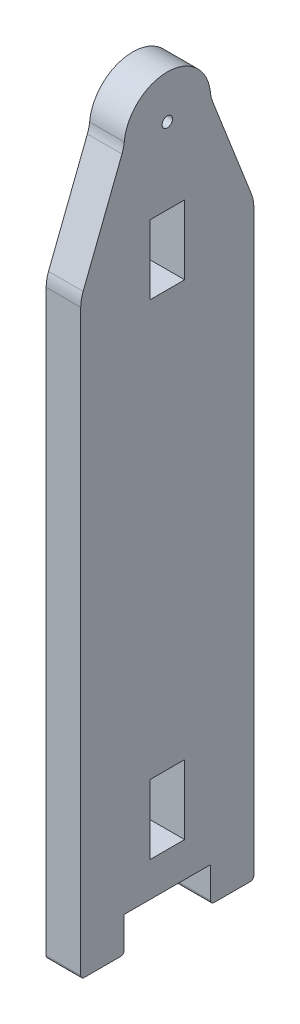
ISO-10303-21;
HEADER;
FILE_DESCRIPTION(('STEP AP214'),'2;1');
FILE_NAME('part.step','',(''),(''),'','','');
FILE_SCHEMA(('AUTOMOTIVE_DESIGN { 1 0 10303 214 1 1 1 1 }'));
ENDSEC;
DATA;
#1=APPLICATION_CONTEXT('core data for automotive mechanical design processes');
#2=APPLICATION_PROTOCOL_DEFINITION('international standard','automotive_design',2000,#1);
#3=PRODUCT_CONTEXT('',#1,'mechanical');
#4=PRODUCT('Part','Part','',(#3));
#5=PRODUCT_RELATED_PRODUCT_CATEGORY('part','',(#4));
#6=PRODUCT_DEFINITION_FORMATION('','',#4);
#7=PRODUCT_DEFINITION_CONTEXT('part definition',#1,'design');
#8=PRODUCT_DEFINITION('design','',#6,#7);
#9=PRODUCT_DEFINITION_SHAPE('','',#8);
#10=(LENGTH_UNIT() NAMED_UNIT(*) SI_UNIT(.MILLI.,.METRE.));
#11=(NAMED_UNIT(*) PLANE_ANGLE_UNIT() SI_UNIT($,.RADIAN.));
#12=(NAMED_UNIT(*) SI_UNIT($,.STERADIAN.) SOLID_ANGLE_UNIT());
#13=UNCERTAINTY_MEASURE_WITH_UNIT(LENGTH_MEASURE(1.E-05),#10,'distance_accuracy_value','');
#14=(GEOMETRIC_REPRESENTATION_CONTEXT(3) GLOBAL_UNCERTAINTY_ASSIGNED_CONTEXT((#13)) GLOBAL_UNIT_ASSIGNED_CONTEXT((#10,
#11,#12)) REPRESENTATION_CONTEXT('',''));
#15=CARTESIAN_POINT('',(0.,0.,0.));
#16=DIRECTION('',(0.,0.,1.));
#17=DIRECTION('',(1.,0.,0.));
#18=AXIS2_PLACEMENT_3D('',#15,#16,#17);
#19=CARTESIAN_POINT('',(20.,384.,0.));
#20=DIRECTION('',(1.,0.,0.));
#21=DIRECTION('',(0.,0.,-1.));
#22=AXIS2_PLACEMENT_3D('',#19,#20,#21);
#23=PLANE('',#22);
#24=DIRECTION('',(0.,0.,1.));
#25=VECTOR('',#24,1.);
#26=CARTESIAN_POINT('',(20.,340.,10.));
#27=LINE('',#26,#25);
#28=CARTESIAN_POINT('',(20.,340.,-10.));
#29=VERTEX_POINT('',#28);
#30=CARTESIAN_POINT('',(20.,340.,10.));
#31=VERTEX_POINT('',#30);
#32=EDGE_CURVE('E252',#29,#31,#27,.T.);
#33=ORIENTED_EDGE('',*,*,#32,.F.);
#34=DIRECTION('',(0.,1.,0.));
#35=VECTOR('',#34,1.);
#36=CARTESIAN_POINT('',(20.,340.,-10.));
#37=LINE('',#36,#35);
#38=CARTESIAN_POINT('',(20.,300.,-10.));
#39=VERTEX_POINT('',#38);
#40=EDGE_CURVE('E250',#39,#29,#37,.T.);
#41=ORIENTED_EDGE('',*,*,#40,.F.);
#42=DIRECTION('',(0.,0.,-1.));
#43=VECTOR('',#42,1.);
#44=CARTESIAN_POINT('',(20.,300.,10.));
#45=LINE('',#44,#43);
#46=CARTESIAN_POINT('',(20.,300.,10.));
#47=VERTEX_POINT('',#46);
#48=EDGE_CURVE('E258',#47,#39,#45,.T.);
#49=ORIENTED_EDGE('',*,*,#48,.F.);
#50=DIRECTION('',(0.,-1.,0.));
#51=VECTOR('',#50,1.);
#52=CARTESIAN_POINT('',(20.,340.,10.));
#53=LINE('',#52,#51);
#54=EDGE_CURVE('E255',#31,#47,#53,.T.);
#55=ORIENTED_EDGE('',*,*,#54,.F.);
#56=EDGE_LOOP('',(#33,#41,#49,#55));
#57=FACE_BOUND('',#56,.T.);
#58=DIRECTION('',(0.,0.,-1.));
#59=VECTOR('',#58,1.);
#60=CARTESIAN_POINT('',(20.,-20.,-25.));
#61=LINE('',#60,#59);
#62=CARTESIAN_POINT('',(20.,-20.,-27.));
#63=VERTEX_POINT('',#62);
#64=CARTESIAN_POINT('',(20.,-20.,-48.));
#65=VERTEX_POINT('',#64);
#66=EDGE_CURVE('E292',#63,#65,#61,.T.);
#67=ORIENTED_EDGE('',*,*,#66,.T.);
#68=CARTESIAN_POINT('',(20.,-18.,-48.));
#69=DIRECTION('',(1.,0.,0.));
#70=DIRECTION('',(0.,0.,-1.));
#71=AXIS2_PLACEMENT_3D('',#68,#69,#70);
#72=CIRCLE('',#71,2.);
#73=CARTESIAN_POINT('',(20.,-18.,-50.));
#74=VERTEX_POINT('',#73);
#75=EDGE_CURVE('E402',#65,#74,#72,.T.);
#76=ORIENTED_EDGE('',*,*,#75,.T.);
#77=DIRECTION('',(0.,1.,0.));
#78=VECTOR('',#77,1.);
#79=CARTESIAN_POINT('',(20.,-20.,-50.));
#80=LINE('',#79,#78);
#81=CARTESIAN_POINT('',(20.,316.232373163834,-50.));
#82=VERTEX_POINT('',#81);
#83=EDGE_CURVE('E295',#74,#82,#80,.T.);
#84=ORIENTED_EDGE('',*,*,#83,.T.);
#85=CARTESIAN_POINT('',(20.,316.232373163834,-30.));
#86=DIRECTION('',(1.,0.,0.));
#87=DIRECTION('',(0.,0.,-1.));
#88=AXIS2_PLACEMENT_3D('',#85,#86,#87);
#89=CIRCLE('',#88,20.);
#90=CARTESIAN_POINT('',(20.,323.509383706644,-48.6291469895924));
#91=VERTEX_POINT('',#90);
#92=EDGE_CURVE('E358',#82,#91,#89,.T.);
#93=ORIENTED_EDGE('',*,*,#92,.T.);
#94=DIRECTION('',(0.,0.931457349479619,0.363850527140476));
#95=VECTOR('',#94,1.);
#96=CARTESIAN_POINT('',(20.,320.,-50.));
#97=LINE('',#96,#95);
#98=CARTESIAN_POINT('',(20.,381.016058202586,-26.165602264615));
#99=VERTEX_POINT('',#98);
#100=EDGE_CURVE('E297',#91,#99,#97,.T.);
#101=ORIENTED_EDGE('',*,*,#100,.T.);
#102=CARTESIAN_POINT('',(20.,388.293068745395,-44.7947492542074));
#103=DIRECTION('',(1.,0.,0.));
#104=DIRECTION('',(0.,0.,-1.));
#105=AXIS2_PLACEMENT_3D('',#102,#103,#104);
#106=CIRCLE('',#105,20.);
#107=CARTESIAN_POINT('',(20.,386.385038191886,-24.885971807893));
#108=VERTEX_POINT('',#107);
#109=EDGE_CURVE('E375',#99,#108,#106,.F.);
#110=ORIENTED_EDGE('',*,*,#109,.T.);
#111=CARTESIAN_POINT('',(20.,384.,0.));
#112=DIRECTION('',(1.,0.,0.));
#113=DIRECTION('',(0.,0.,-1.));
#114=AXIS2_PLACEMENT_3D('',#111,#112,#113);
#115=CIRCLE('',#114,25.);
#116=CARTESIAN_POINT('',(20.,386.385038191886,24.885971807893));
#117=VERTEX_POINT('',#116);
#118=EDGE_CURVE('E300',#108,#117,#115,.T.);
#119=ORIENTED_EDGE('',*,*,#118,.T.);
#120=CARTESIAN_POINT('',(20.,388.293068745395,44.7947492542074));
#121=DIRECTION('',(1.,0.,0.));
#122=DIRECTION('',(0.,0.,-1.));
#123=AXIS2_PLACEMENT_3D('',#120,#121,#122);
#124=CIRCLE('',#123,20.);
#125=CARTESIAN_POINT('',(20.,381.016058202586,26.165602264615));
#126=VERTEX_POINT('',#125);
#127=EDGE_CURVE('E379',#117,#126,#124,.F.);
#128=ORIENTED_EDGE('',*,*,#127,.T.);
#129=DIRECTION('',(0.,-0.931457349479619,0.363850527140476));
#130=VECTOR('',#129,1.);
#131=CARTESIAN_POINT('',(20.,320.,50.));
#132=LINE('',#131,#130);
#133=CARTESIAN_POINT('',(20.,323.509383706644,48.6291469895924));
#134=VERTEX_POINT('',#133);
#135=EDGE_CURVE('E303',#126,#134,#132,.T.);
#136=ORIENTED_EDGE('',*,*,#135,.T.);
#137=CARTESIAN_POINT('',(20.,316.232373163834,30.));
#138=DIRECTION('',(1.,0.,0.));
#139=DIRECTION('',(0.,0.,-1.));
#140=AXIS2_PLACEMENT_3D('',#137,#138,#139);
#141=CIRCLE('',#140,20.);
#142=CARTESIAN_POINT('',(20.,316.232373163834,50.));
#143=VERTEX_POINT('',#142);
#144=EDGE_CURVE('E356',#134,#143,#141,.T.);
#145=ORIENTED_EDGE('',*,*,#144,.T.);
#146=DIRECTION('',(0.,-1.,0.));
#147=VECTOR('',#146,1.);
#148=CARTESIAN_POINT('',(20.,-20.,50.));
#149=LINE('',#148,#147);
#150=CARTESIAN_POINT('',(20.,-18.,50.));
#151=VERTEX_POINT('',#150);
#152=EDGE_CURVE('E306',#143,#151,#149,.T.);
#153=ORIENTED_EDGE('',*,*,#152,.T.);
#154=CARTESIAN_POINT('',(20.,-18.,48.));
#155=DIRECTION('',(1.,0.,0.));
#156=DIRECTION('',(0.,0.,-1.));
#157=AXIS2_PLACEMENT_3D('',#154,#155,#156);
#158=CIRCLE('',#157,2.);
#159=CARTESIAN_POINT('',(20.,-20.,48.));
#160=VERTEX_POINT('',#159);
#161=EDGE_CURVE('E398',#151,#160,#158,.T.);
#162=ORIENTED_EDGE('',*,*,#161,.T.);
#163=DIRECTION('',(0.,0.,-1.));
#164=VECTOR('',#163,1.);
#165=CARTESIAN_POINT('',(20.,-20.,25.));
#166=LINE('',#165,#164);
#167=CARTESIAN_POINT('',(20.,-20.,27.));
#168=VERTEX_POINT('',#167);
#169=EDGE_CURVE('E309',#160,#168,#166,.T.);
#170=ORIENTED_EDGE('',*,*,#169,.T.);
#171=CARTESIAN_POINT('',(20.,-18.,27.));
#172=DIRECTION('',(1.,0.,0.));
#173=DIRECTION('',(0.,0.,-1.));
#174=AXIS2_PLACEMENT_3D('',#171,#172,#173);
#175=CIRCLE('',#174,2.);
#176=CARTESIAN_POINT('',(20.,-18.,25.));
#177=VERTEX_POINT('',#176);
#178=EDGE_CURVE('E55',#168,#177,#175,.T.);
#179=ORIENTED_EDGE('',*,*,#178,.T.);
#180=DIRECTION('',(0.,1.,0.));
#181=VECTOR('',#180,1.);
#182=CARTESIAN_POINT('',(20.,0.,25.));
#183=LINE('',#182,#181);
#184=CARTESIAN_POINT('',(20.,0.,25.));
#185=VERTEX_POINT('',#184);
#186=EDGE_CURVE('E311',#177,#185,#183,.T.);
#187=ORIENTED_EDGE('',*,*,#186,.T.);
#188=DIRECTION('',(0.,0.,-1.));
#189=VECTOR('',#188,1.);
#190=CARTESIAN_POINT('',(20.,0.,0.));
#191=LINE('',#190,#189);
#192=CARTESIAN_POINT('',(20.,0.,-25.));
#193=VERTEX_POINT('',#192);
#194=EDGE_CURVE('E287',#185,#193,#191,.T.);
#195=ORIENTED_EDGE('',*,*,#194,.T.);
#196=DIRECTION('',(0.,-1.,0.));
#197=VECTOR('',#196,1.);
#198=CARTESIAN_POINT('',(20.,0.,-25.));
#199=LINE('',#198,#197);
#200=CARTESIAN_POINT('',(20.,-18.,-25.));
#201=VERTEX_POINT('',#200);
#202=EDGE_CURVE('E289',#193,#201,#199,.T.);
#203=ORIENTED_EDGE('',*,*,#202,.T.);
#204=CARTESIAN_POINT('',(20.,-18.,-27.));
#205=DIRECTION('',(1.,0.,0.));
#206=DIRECTION('',(0.,0.,-1.));
#207=AXIS2_PLACEMENT_3D('',#204,#205,#206);
#208=CIRCLE('',#207,2.);
#209=EDGE_CURVE('E400',#201,#63,#208,.T.);
#210=ORIENTED_EDGE('',*,*,#209,.T.);
#211=EDGE_LOOP('',(#67,#76,#84,#93,#101,#110,#119,#128,#136,#145,#153,#162,#170,#179,#187,#195,
#203,#210));
#212=FACE_BOUND('',#211,.T.);
#213=CARTESIAN_POINT('',(20.,384.,0.));
#214=DIRECTION('',(1.,0.,0.));
#215=DIRECTION('',(0.,0.,-1.));
#216=AXIS2_PLACEMENT_3D('',#213,#214,#215);
#217=CIRCLE('',#216,3.);
#218=CARTESIAN_POINT('',(20.,384.,-3.));
#219=VERTEX_POINT('',#218);
#220=EDGE_CURVE('E281',#219,#219,#217,.T.);
#221=ORIENTED_EDGE('',*,*,#220,.F.);
#222=EDGE_LOOP('',(#221));
#223=FACE_BOUND('',#222,.T.);
#224=DIRECTION('',(0.,0.,1.));
#225=VECTOR('',#224,1.);
#226=CARTESIAN_POINT('',(20.,60.,10.));
#227=LINE('',#226,#225);
#228=CARTESIAN_POINT('',(20.,60.,-10.));
#229=VERTEX_POINT('',#228);
#230=CARTESIAN_POINT('',(20.,60.,10.));
#231=VERTEX_POINT('',#230);
#232=EDGE_CURVE('E219',#229,#231,#227,.T.);
#233=ORIENTED_EDGE('',*,*,#232,.F.);
#234=DIRECTION('',(0.,1.,0.));
#235=VECTOR('',#234,1.);
#236=CARTESIAN_POINT('',(20.,60.,-10.));
#237=LINE('',#236,#235);
#238=CARTESIAN_POINT('',(20.,20.,-10.));
#239=VERTEX_POINT('',#238);
#240=EDGE_CURVE('E209',#239,#229,#237,.T.);
#241=ORIENTED_EDGE('',*,*,#240,.F.);
#242=DIRECTION('',(0.,0.,-1.));
#243=VECTOR('',#242,1.);
#244=CARTESIAN_POINT('',(20.,20.,10.));
#245=LINE('',#244,#243);
#246=CARTESIAN_POINT('',(20.,20.,10.));
#247=VERTEX_POINT('',#246);
#248=EDGE_CURVE('E234',#247,#239,#245,.T.);
#249=ORIENTED_EDGE('',*,*,#248,.F.);
#250=DIRECTION('',(0.,-1.,0.));
#251=VECTOR('',#250,1.);
#252=CARTESIAN_POINT('',(20.,60.,10.));
#253=LINE('',#252,#251);
#254=EDGE_CURVE('E232',#231,#247,#253,.T.);
#255=ORIENTED_EDGE('',*,*,#254,.F.);
#256=EDGE_LOOP('',(#233,#241,#249,#255));
#257=FACE_BOUND('',#256,.T.);
#258=ADVANCED_FACE('F32',(#57,#212,#223,#257),#23,.T.);
#259=CARTESIAN_POINT('',(0.,384.,0.));
#260=DIRECTION('',(1.,0.,0.));
#261=DIRECTION('',(0.,0.,-1.));
#262=AXIS2_PLACEMENT_3D('',#259,#260,#261);
#263=PLANE('',#262);
#264=DIRECTION('',(0.,1.,0.));
#265=VECTOR('',#264,1.);
#266=CARTESIAN_POINT('',(0.,340.,-10.));
#267=LINE('',#266,#265);
#268=CARTESIAN_POINT('',(0.,300.,-10.));
#269=VERTEX_POINT('',#268);
#270=CARTESIAN_POINT('',(0.,340.,-10.));
#271=VERTEX_POINT('',#270);
#272=EDGE_CURVE('E227',#269,#271,#267,.T.);
#273=ORIENTED_EDGE('',*,*,#272,.T.);
#274=DIRECTION('',(0.,0.,1.));
#275=VECTOR('',#274,1.);
#276=CARTESIAN_POINT('',(0.,340.,10.));
#277=LINE('',#276,#275);
#278=CARTESIAN_POINT('',(0.,340.,10.));
#279=VERTEX_POINT('',#278);
#280=EDGE_CURVE('E263',#271,#279,#277,.T.);
#281=ORIENTED_EDGE('',*,*,#280,.T.);
#282=DIRECTION('',(0.,-1.,0.));
#283=VECTOR('',#282,1.);
#284=CARTESIAN_POINT('',(0.,340.,10.));
#285=LINE('',#284,#283);
#286=CARTESIAN_POINT('',(0.,300.,10.));
#287=VERTEX_POINT('',#286);
#288=EDGE_CURVE('E266',#279,#287,#285,.T.);
#289=ORIENTED_EDGE('',*,*,#288,.T.);
#290=DIRECTION('',(0.,0.,-1.));
#291=VECTOR('',#290,1.);
#292=CARTESIAN_POINT('',(0.,300.,10.));
#293=LINE('',#292,#291);
#294=EDGE_CURVE('E253',#287,#269,#293,.T.);
#295=ORIENTED_EDGE('',*,*,#294,.T.);
#296=EDGE_LOOP('',(#273,#281,#289,#295));
#297=FACE_BOUND('',#296,.T.);
#298=DIRECTION('',(0.,1.,0.));
#299=VECTOR('',#298,1.);
#300=CARTESIAN_POINT('',(0.,-20.,-50.));
#301=LINE('',#300,#299);
#302=CARTESIAN_POINT('',(0.,-18.,-50.));
#303=VERTEX_POINT('',#302);
#304=CARTESIAN_POINT('',(0.,316.232373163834,-50.));
#305=VERTEX_POINT('',#304);
#306=EDGE_CURVE('E320',#303,#305,#301,.T.);
#307=ORIENTED_EDGE('',*,*,#306,.F.);
#308=CARTESIAN_POINT('',(0.,-18.,-48.));
#309=DIRECTION('',(1.,0.,0.));
#310=DIRECTION('',(0.,0.,-1.));
#311=AXIS2_PLACEMENT_3D('',#308,#309,#310);
#312=CIRCLE('',#311,2.);
#313=CARTESIAN_POINT('',(0.,-20.,-48.));
#314=VERTEX_POINT('',#313);
#315=EDGE_CURVE('E390',#303,#314,#312,.F.);
#316=ORIENTED_EDGE('',*,*,#315,.T.);
#317=DIRECTION('',(0.,0.,-1.));
#318=VECTOR('',#317,1.);
#319=CARTESIAN_POINT('',(0.,-20.,-25.));
#320=LINE('',#319,#318);
#321=CARTESIAN_POINT('',(0.,-20.,-27.));
#322=VERTEX_POINT('',#321);
#323=EDGE_CURVE('E317',#322,#314,#320,.T.);
#324=ORIENTED_EDGE('',*,*,#323,.F.);
#325=CARTESIAN_POINT('',(0.,-18.,-27.));
#326=DIRECTION('',(1.,0.,0.));
#327=DIRECTION('',(0.,0.,-1.));
#328=AXIS2_PLACEMENT_3D('',#325,#326,#327);
#329=CIRCLE('',#328,2.);
#330=CARTESIAN_POINT('',(0.,-18.,-25.));
#331=VERTEX_POINT('',#330);
#332=EDGE_CURVE('E388',#322,#331,#329,.F.);
#333=ORIENTED_EDGE('',*,*,#332,.T.);
#334=DIRECTION('',(0.,-1.,0.));
#335=VECTOR('',#334,1.);
#336=CARTESIAN_POINT('',(0.,0.,-25.));
#337=LINE('',#336,#335);
#338=CARTESIAN_POINT('',(0.,0.,-25.));
#339=VERTEX_POINT('',#338);
#340=EDGE_CURVE('E315',#339,#331,#337,.T.);
#341=ORIENTED_EDGE('',*,*,#340,.F.);
#342=DIRECTION('',(0.,0.,-1.));
#343=VECTOR('',#342,1.);
#344=CARTESIAN_POINT('',(0.,0.,0.));
#345=LINE('',#344,#343);
#346=CARTESIAN_POINT('',(0.,0.,25.));
#347=VERTEX_POINT('',#346);
#348=EDGE_CURVE('E284',#347,#339,#345,.T.);
#349=ORIENTED_EDGE('',*,*,#348,.F.);
#350=DIRECTION('',(0.,1.,0.));
#351=VECTOR('',#350,1.);
#352=CARTESIAN_POINT('',(0.,0.,25.));
#353=LINE('',#352,#351);
#354=CARTESIAN_POINT('',(0.,-18.,25.));
#355=VERTEX_POINT('',#354);
#356=EDGE_CURVE('E290',#355,#347,#353,.T.);
#357=ORIENTED_EDGE('',*,*,#356,.F.);
#358=CARTESIAN_POINT('',(0.,-18.,27.));
#359=DIRECTION('',(1.,0.,0.));
#360=DIRECTION('',(0.,0.,-1.));
#361=AXIS2_PLACEMENT_3D('',#358,#359,#360);
#362=CIRCLE('',#361,2.);
#363=CARTESIAN_POINT('',(0.,-20.,27.));
#364=VERTEX_POINT('',#363);
#365=EDGE_CURVE('E384',#355,#364,#362,.F.);
#366=ORIENTED_EDGE('',*,*,#365,.T.);
#367=DIRECTION('',(0.,0.,-1.));
#368=VECTOR('',#367,1.);
#369=CARTESIAN_POINT('',(0.,-20.,25.));
#370=LINE('',#369,#368);
#371=CARTESIAN_POINT('',(0.,-20.,48.));
#372=VERTEX_POINT('',#371);
#373=EDGE_CURVE('E334',#372,#364,#370,.T.);
#374=ORIENTED_EDGE('',*,*,#373,.F.);
#375=CARTESIAN_POINT('',(0.,-18.,48.));
#376=DIRECTION('',(1.,0.,0.));
#377=DIRECTION('',(0.,0.,-1.));
#378=AXIS2_PLACEMENT_3D('',#375,#376,#377);
#379=CIRCLE('',#378,2.);
#380=CARTESIAN_POINT('',(0.,-18.,50.));
#381=VERTEX_POINT('',#380);
#382=EDGE_CURVE('E386',#372,#381,#379,.F.);
#383=ORIENTED_EDGE('',*,*,#382,.T.);
#384=DIRECTION('',(0.,-1.,0.));
#385=VECTOR('',#384,1.);
#386=CARTESIAN_POINT('',(0.,-20.,50.));
#387=LINE('',#386,#385);
#388=CARTESIAN_POINT('',(0.,316.232373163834,50.));
#389=VERTEX_POINT('',#388);
#390=EDGE_CURVE('E331',#389,#381,#387,.T.);
#391=ORIENTED_EDGE('',*,*,#390,.F.);
#392=CARTESIAN_POINT('',(0.,316.232373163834,30.));
#393=DIRECTION('',(1.,0.,0.));
#394=DIRECTION('',(0.,0.,-1.));
#395=AXIS2_PLACEMENT_3D('',#392,#393,#394);
#396=CIRCLE('',#395,20.);
#397=CARTESIAN_POINT('',(0.,323.509383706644,48.6291469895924));
#398=VERTEX_POINT('',#397);
#399=EDGE_CURVE('E348',#389,#398,#396,.F.);
#400=ORIENTED_EDGE('',*,*,#399,.T.);
#401=DIRECTION('',(0.,-0.931457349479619,0.363850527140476));
#402=VECTOR('',#401,1.);
#403=CARTESIAN_POINT('',(0.,320.,50.));
#404=LINE('',#403,#402);
#405=CARTESIAN_POINT('',(0.,381.016058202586,26.165602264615));
#406=VERTEX_POINT('',#405);
#407=EDGE_CURVE('E328',#406,#398,#404,.T.);
#408=ORIENTED_EDGE('',*,*,#407,.F.);
#409=CARTESIAN_POINT('',(0.,388.293068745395,44.7947492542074));
#410=DIRECTION('',(1.,0.,0.));
#411=DIRECTION('',(0.,0.,-1.));
#412=AXIS2_PLACEMENT_3D('',#409,#410,#411);
#413=CIRCLE('',#412,20.);
#414=CARTESIAN_POINT('',(0.,386.385038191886,24.885971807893));
#415=VERTEX_POINT('',#414);
#416=EDGE_CURVE('E377',#406,#415,#413,.T.);
#417=ORIENTED_EDGE('',*,*,#416,.T.);
#418=CARTESIAN_POINT('',(0.,384.,0.));
#419=DIRECTION('',(1.,0.,0.));
#420=DIRECTION('',(0.,0.,-1.));
#421=AXIS2_PLACEMENT_3D('',#418,#419,#420);
#422=CIRCLE('',#421,25.);
#423=CARTESIAN_POINT('',(0.,386.385038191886,-24.885971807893));
#424=VERTEX_POINT('',#423);
#425=EDGE_CURVE('E325',#424,#415,#422,.T.);
#426=ORIENTED_EDGE('',*,*,#425,.F.);
#427=CARTESIAN_POINT('',(0.,388.293068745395,-44.7947492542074));
#428=DIRECTION('',(1.,0.,0.));
#429=DIRECTION('',(0.,0.,-1.));
#430=AXIS2_PLACEMENT_3D('',#427,#428,#429);
#431=CIRCLE('',#430,20.);
#432=CARTESIAN_POINT('',(0.,381.016058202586,-26.165602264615));
#433=VERTEX_POINT('',#432);
#434=EDGE_CURVE('E373',#424,#433,#431,.T.);
#435=ORIENTED_EDGE('',*,*,#434,.T.);
#436=DIRECTION('',(0.,0.931457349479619,0.363850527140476));
#437=VECTOR('',#436,1.);
#438=CARTESIAN_POINT('',(0.,320.,-50.));
#439=LINE('',#438,#437);
#440=CARTESIAN_POINT('',(0.,323.509383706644,-48.6291469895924));
#441=VERTEX_POINT('',#440);
#442=EDGE_CURVE('E322',#441,#433,#439,.T.);
#443=ORIENTED_EDGE('',*,*,#442,.F.);
#444=CARTESIAN_POINT('',(0.,316.232373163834,-30.));
#445=DIRECTION('',(1.,0.,0.));
#446=DIRECTION('',(0.,0.,-1.));
#447=AXIS2_PLACEMENT_3D('',#444,#445,#446);
#448=CIRCLE('',#447,20.);
#449=EDGE_CURVE('E350',#441,#305,#448,.F.);
#450=ORIENTED_EDGE('',*,*,#449,.T.);
#451=EDGE_LOOP('',(#307,#316,#324,#333,#341,#349,#357,#366,#374,#383,#391,#400,#408,#417,#426,
#435,#443,#450));
#452=FACE_BOUND('',#451,.T.);
#453=CARTESIAN_POINT('',(0.,384.,0.));
#454=DIRECTION('',(1.,0.,0.));
#455=DIRECTION('',(0.,0.,-1.));
#456=AXIS2_PLACEMENT_3D('',#453,#454,#455);
#457=CIRCLE('',#456,3.);
#458=CARTESIAN_POINT('',(0.,384.,-3.));
#459=VERTEX_POINT('',#458);
#460=EDGE_CURVE('E280',#459,#459,#457,.T.);
#461=ORIENTED_EDGE('',*,*,#460,.T.);
#462=EDGE_LOOP('',(#461));
#463=FACE_BOUND('',#462,.T.);
#464=DIRECTION('',(0.,1.,0.));
#465=VECTOR('',#464,1.);
#466=CARTESIAN_POINT('',(0.,60.,-10.));
#467=LINE('',#466,#465);
#468=CARTESIAN_POINT('',(0.,20.,-10.));
#469=VERTEX_POINT('',#468);
#470=CARTESIAN_POINT('',(0.,60.,-10.));
#471=VERTEX_POINT('',#470);
#472=EDGE_CURVE('E238',#469,#471,#467,.T.);
#473=ORIENTED_EDGE('',*,*,#472,.T.);
#474=DIRECTION('',(0.,0.,1.));
#475=VECTOR('',#474,1.);
#476=CARTESIAN_POINT('',(0.,60.,10.));
#477=LINE('',#476,#475);
#478=CARTESIAN_POINT('',(0.,60.,10.));
#479=VERTEX_POINT('',#478);
#480=EDGE_CURVE('E226',#471,#479,#477,.T.);
#481=ORIENTED_EDGE('',*,*,#480,.T.);
#482=DIRECTION('',(0.,-1.,0.));
#483=VECTOR('',#482,1.);
#484=CARTESIAN_POINT('',(0.,60.,10.));
#485=LINE('',#484,#483);
#486=CARTESIAN_POINT('',(0.,20.,10.));
#487=VERTEX_POINT('',#486);
#488=EDGE_CURVE('E241',#479,#487,#485,.T.);
#489=ORIENTED_EDGE('',*,*,#488,.T.);
#490=DIRECTION('',(0.,0.,-1.));
#491=VECTOR('',#490,1.);
#492=CARTESIAN_POINT('',(0.,20.,10.));
#493=LINE('',#492,#491);
#494=EDGE_CURVE('E220',#487,#469,#493,.T.);
#495=ORIENTED_EDGE('',*,*,#494,.T.);
#496=EDGE_LOOP('',(#473,#481,#489,#495));
#497=FACE_BOUND('',#496,.T.);
#498=ADVANCED_FACE('F428',(#297,#452,#463,#497),#263,.F.);
#499=CARTESIAN_POINT('',(20.,0.,0.));
#500=DIRECTION('',(0.,1.,0.));
#501=DIRECTION('',(0.,0.,1.));
#502=AXIS2_PLACEMENT_3D('',#499,#500,#501);
#503=PLANE('',#502);
#504=ORIENTED_EDGE('',*,*,#348,.T.);
#505=DIRECTION('',(-1.,0.,0.));
#506=VECTOR('',#505,1.);
#507=CARTESIAN_POINT('',(20.,0.,-25.));
#508=LINE('',#507,#506);
#509=EDGE_CURVE('E340',#193,#339,#508,.T.);
#510=ORIENTED_EDGE('',*,*,#509,.F.);
#511=ORIENTED_EDGE('',*,*,#194,.F.);
#512=DIRECTION('',(-1.,0.,0.));
#513=VECTOR('',#512,1.);
#514=CARTESIAN_POINT('',(20.,0.,25.));
#515=LINE('',#514,#513);
#516=EDGE_CURVE('E313',#185,#347,#515,.T.);
#517=ORIENTED_EDGE('',*,*,#516,.T.);
#518=EDGE_LOOP('',(#504,#510,#511,#517));
#519=FACE_BOUND('',#518,.T.);
#520=ADVANCED_FACE('F441',(#519),#503,.F.);
#521=CARTESIAN_POINT('',(20.,0.,-25.));
#522=DIRECTION('',(0.,0.,-1.));
#523=DIRECTION('',(0.,1.,0.));
#524=AXIS2_PLACEMENT_3D('',#521,#522,#523);
#525=PLANE('',#524);
#526=ORIENTED_EDGE('',*,*,#340,.T.);
#527=DIRECTION('',(-1.,0.,0.));
#528=VECTOR('',#527,1.);
#529=CARTESIAN_POINT('',(20.,-18.,-25.));
#530=LINE('',#529,#528);
#531=EDGE_CURVE('E47',#331,#201,#530,.F.);
#532=ORIENTED_EDGE('',*,*,#531,.T.);
#533=ORIENTED_EDGE('',*,*,#202,.F.);
#534=ORIENTED_EDGE('',*,*,#509,.T.);
#535=EDGE_LOOP('',(#526,#532,#533,#534));
#536=FACE_BOUND('',#535,.T.);
#537=ADVANCED_FACE('F443',(#536),#525,.F.);
#538=CARTESIAN_POINT('',(20.,-20.,-25.));
#539=DIRECTION('',(0.,1.,0.));
#540=DIRECTION('',(0.,0.,1.));
#541=AXIS2_PLACEMENT_3D('',#538,#539,#540);
#542=PLANE('',#541);
#543=ORIENTED_EDGE('',*,*,#323,.T.);
#544=DIRECTION('',(-1.,0.,0.));
#545=VECTOR('',#544,1.);
#546=CARTESIAN_POINT('',(20.,-20.,-48.));
#547=LINE('',#546,#545);
#548=EDGE_CURVE('E395',#314,#65,#547,.F.);
#549=ORIENTED_EDGE('',*,*,#548,.T.);
#550=ORIENTED_EDGE('',*,*,#66,.F.);
#551=DIRECTION('',(-1.,0.,0.));
#552=VECTOR('',#551,1.);
#553=CARTESIAN_POINT('',(20.,-20.,-27.));
#554=LINE('',#553,#552);
#555=EDGE_CURVE('E392',#63,#322,#554,.T.);
#556=ORIENTED_EDGE('',*,*,#555,.T.);
#557=EDGE_LOOP('',(#543,#549,#550,#556));
#558=FACE_BOUND('',#557,.T.);
#559=ADVANCED_FACE('F445',(#558),#542,.F.);
#560=CARTESIAN_POINT('',(20.,-20.,-50.));
#561=DIRECTION('',(0.,0.,1.));
#562=DIRECTION('',(1.,0.,0.));
#563=AXIS2_PLACEMENT_3D('',#560,#561,#562);
#564=PLANE('',#563);
#565=ORIENTED_EDGE('',*,*,#83,.F.);
#566=DIRECTION('',(-1.,0.,0.));
#567=VECTOR('',#566,1.);
#568=CARTESIAN_POINT('',(20.,-18.,-50.));
#569=LINE('',#568,#567);
#570=EDGE_CURVE('E381',#74,#303,#569,.T.);
#571=ORIENTED_EDGE('',*,*,#570,.T.);
#572=ORIENTED_EDGE('',*,*,#306,.T.);
#573=DIRECTION('',(-1.,0.,0.));
#574=VECTOR('',#573,1.);
#575=CARTESIAN_POINT('',(20.,316.232373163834,-50.));
#576=LINE('',#575,#574);
#577=EDGE_CURVE('E353',#305,#82,#576,.F.);
#578=ORIENTED_EDGE('',*,*,#577,.T.);
#579=EDGE_LOOP('',(#565,#571,#572,#578));
#580=FACE_BOUND('',#579,.T.);
#581=ADVANCED_FACE('F451',(#580),#564,.F.);
#582=CARTESIAN_POINT('',(20.,320.,-50.));
#583=DIRECTION('',(0.,-0.363850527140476,0.931457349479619));
#584=DIRECTION('',(0.,-0.931457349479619,-0.363850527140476));
#585=AXIS2_PLACEMENT_3D('',#582,#583,#584);
#586=PLANE('',#585);
#587=ORIENTED_EDGE('',*,*,#100,.F.);
#588=DIRECTION('',(-1.,0.,0.));
#589=VECTOR('',#588,1.);
#590=CARTESIAN_POINT('',(20.,323.509383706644,-48.6291469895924));
#591=LINE('',#590,#589);
#592=EDGE_CURVE('E345',#91,#441,#591,.T.);
#593=ORIENTED_EDGE('',*,*,#592,.T.);
#594=ORIENTED_EDGE('',*,*,#442,.T.);
#595=DIRECTION('',(1.,0.,0.));
#596=VECTOR('',#595,1.);
#597=CARTESIAN_POINT('',(20.,381.016058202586,-26.165602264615));
#598=LINE('',#597,#596);
#599=EDGE_CURVE('E343',#433,#99,#598,.T.);
#600=ORIENTED_EDGE('',*,*,#599,.T.);
#601=EDGE_LOOP('',(#587,#593,#594,#600));
#602=FACE_BOUND('',#601,.T.);
#603=ADVANCED_FACE('F481',(#602),#586,.F.);
#604=CARTESIAN_POINT('',(20.,384.,0.));
#605=DIRECTION('',(-1.,0.,0.));
#606=DIRECTION('',(0.,0.,1.));
#607=AXIS2_PLACEMENT_3D('',#604,#605,#606);
#608=CYLINDRICAL_SURFACE('',#607,25.);
#609=ORIENTED_EDGE('',*,*,#118,.F.);
#610=DIRECTION('',(-1.,0.,0.));
#611=VECTOR('',#610,1.);
#612=CARTESIAN_POINT('',(20.,386.385038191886,-24.885971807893));
#613=LINE('',#612,#611);
#614=EDGE_CURVE('E362',#108,#424,#613,.T.);
#615=ORIENTED_EDGE('',*,*,#614,.T.);
#616=ORIENTED_EDGE('',*,*,#425,.T.);
#617=DIRECTION('',(-1.,0.,0.));
#618=VECTOR('',#617,1.);
#619=CARTESIAN_POINT('',(20.,386.385038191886,24.885971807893));
#620=LINE('',#619,#618);
#621=EDGE_CURVE('E360',#415,#117,#620,.F.);
#622=ORIENTED_EDGE('',*,*,#621,.T.);
#623=EDGE_LOOP('',(#609,#615,#616,#622));
#624=FACE_BOUND('',#623,.T.);
#625=ADVANCED_FACE('F477',(#624),#608,.T.);
#626=CARTESIAN_POINT('',(20.,320.,50.));
#627=DIRECTION('',(0.,-0.363850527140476,-0.931457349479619));
#628=DIRECTION('',(0.,0.931457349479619,-0.363850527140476));
#629=AXIS2_PLACEMENT_3D('',#626,#627,#628);
#630=PLANE('',#629);
#631=ORIENTED_EDGE('',*,*,#135,.F.);
#632=DIRECTION('',(1.,0.,0.));
#633=VECTOR('',#632,1.);
#634=CARTESIAN_POINT('',(0.,381.016058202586,26.165602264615));
#635=LINE('',#634,#633);
#636=EDGE_CURVE('E367',#126,#406,#635,.F.);
#637=ORIENTED_EDGE('',*,*,#636,.T.);
#638=ORIENTED_EDGE('',*,*,#407,.T.);
#639=DIRECTION('',(-1.,0.,0.));
#640=VECTOR('',#639,1.);
#641=CARTESIAN_POINT('',(20.,323.509383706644,48.6291469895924));
#642=LINE('',#641,#640);
#643=EDGE_CURVE('E365',#398,#134,#642,.F.);
#644=ORIENTED_EDGE('',*,*,#643,.T.);
#645=EDGE_LOOP('',(#631,#637,#638,#644));
#646=FACE_BOUND('',#645,.T.);
#647=ADVANCED_FACE('F474',(#646),#630,.F.);
#648=CARTESIAN_POINT('',(20.,-20.,50.));
#649=DIRECTION('',(0.,0.,-1.));
#650=DIRECTION('',(-1.,0.,0.));
#651=AXIS2_PLACEMENT_3D('',#648,#649,#650);
#652=PLANE('',#651);
#653=ORIENTED_EDGE('',*,*,#390,.T.);
#654=DIRECTION('',(-1.,0.,0.));
#655=VECTOR('',#654,1.);
#656=CARTESIAN_POINT('',(20.,-18.,50.));
#657=LINE('',#656,#655);
#658=EDGE_CURVE('E40',#381,#151,#657,.F.);
#659=ORIENTED_EDGE('',*,*,#658,.T.);
#660=ORIENTED_EDGE('',*,*,#152,.F.);
#661=DIRECTION('',(-1.,0.,0.));
#662=VECTOR('',#661,1.);
#663=CARTESIAN_POINT('',(20.,316.232373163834,50.));
#664=LINE('',#663,#662);
#665=EDGE_CURVE('E370',#143,#389,#664,.T.);
#666=ORIENTED_EDGE('',*,*,#665,.T.);
#667=EDGE_LOOP('',(#653,#659,#660,#666));
#668=FACE_BOUND('',#667,.T.);
#669=ADVANCED_FACE('F412',(#668),#652,.F.);
#670=CARTESIAN_POINT('',(20.,-20.,25.));
#671=DIRECTION('',(0.,1.,0.));
#672=DIRECTION('',(0.,0.,1.));
#673=AXIS2_PLACEMENT_3D('',#670,#671,#672);
#674=PLANE('',#673);
#675=ORIENTED_EDGE('',*,*,#169,.F.);
#676=DIRECTION('',(-1.,0.,0.));
#677=VECTOR('',#676,1.);
#678=CARTESIAN_POINT('',(20.,-20.,48.));
#679=LINE('',#678,#677);
#680=EDGE_CURVE('E407',#160,#372,#679,.T.);
#681=ORIENTED_EDGE('',*,*,#680,.T.);
#682=ORIENTED_EDGE('',*,*,#373,.T.);
#683=DIRECTION('',(-1.,0.,0.));
#684=VECTOR('',#683,1.);
#685=CARTESIAN_POINT('',(20.,-20.,27.));
#686=LINE('',#685,#684);
#687=EDGE_CURVE('E405',#364,#168,#686,.F.);
#688=ORIENTED_EDGE('',*,*,#687,.T.);
#689=EDGE_LOOP('',(#675,#681,#682,#688));
#690=FACE_BOUND('',#689,.T.);
#691=ADVANCED_FACE('F424',(#690),#674,.F.);
#692=CARTESIAN_POINT('',(20.,0.,25.));
#693=DIRECTION('',(0.,0.,1.));
#694=DIRECTION('',(1.,0.,0.));
#695=AXIS2_PLACEMENT_3D('',#692,#693,#694);
#696=PLANE('',#695);
#697=ORIENTED_EDGE('',*,*,#186,.F.);
#698=DIRECTION('',(-1.,0.,0.));
#699=VECTOR('',#698,1.);
#700=CARTESIAN_POINT('',(20.,-18.,25.));
#701=LINE('',#700,#699);
#702=EDGE_CURVE('E11',#177,#355,#701,.T.);
#703=ORIENTED_EDGE('',*,*,#702,.T.);
#704=ORIENTED_EDGE('',*,*,#356,.T.);
#705=ORIENTED_EDGE('',*,*,#516,.F.);
#706=EDGE_LOOP('',(#697,#703,#704,#705));
#707=FACE_BOUND('',#706,.T.);
#708=ADVANCED_FACE('F435',(#707),#696,.F.);
#709=CARTESIAN_POINT('',(20.,384.,0.));
#710=DIRECTION('',(-1.,0.,0.));
#711=DIRECTION('',(0.,0.,1.));
#712=AXIS2_PLACEMENT_3D('',#709,#710,#711);
#713=CYLINDRICAL_SURFACE('',#712,3.);
#714=ORIENTED_EDGE('',*,*,#220,.T.);
#715=EDGE_LOOP('',(#714));
#716=FACE_BOUND('',#715,.T.);
#717=ORIENTED_EDGE('',*,*,#460,.F.);
#718=EDGE_LOOP('',(#717));
#719=FACE_BOUND('',#718,.T.);
#720=ADVANCED_FACE('F465',(#716,#719),#713,.F.);
#721=CARTESIAN_POINT('',(20.,340.,-10.));
#722=DIRECTION('',(0.,0.,1.));
#723=DIRECTION('',(0.,-1.,0.));
#724=AXIS2_PLACEMENT_3D('',#721,#722,#723);
#725=PLANE('',#724);
#726=ORIENTED_EDGE('',*,*,#272,.F.);
#727=DIRECTION('',(-1.,0.,0.));
#728=VECTOR('',#727,1.);
#729=CARTESIAN_POINT('',(20.,300.,-10.));
#730=LINE('',#729,#728);
#731=EDGE_CURVE('E260',#39,#269,#730,.T.);
#732=ORIENTED_EDGE('',*,*,#731,.F.);
#733=ORIENTED_EDGE('',*,*,#40,.T.);
#734=DIRECTION('',(-1.,0.,0.));
#735=VECTOR('',#734,1.);
#736=CARTESIAN_POINT('',(20.,340.,-10.));
#737=LINE('',#736,#735);
#738=EDGE_CURVE('E277',#29,#271,#737,.T.);
#739=ORIENTED_EDGE('',*,*,#738,.T.);
#740=EDGE_LOOP('',(#726,#732,#733,#739));
#741=FACE_BOUND('',#740,.T.);
#742=ADVANCED_FACE('F568',(#741),#725,.T.);
#743=CARTESIAN_POINT('',(20.,340.,10.));
#744=DIRECTION('',(0.,-1.,0.));
#745=DIRECTION('',(0.,0.,-1.));
#746=AXIS2_PLACEMENT_3D('',#743,#744,#745);
#747=PLANE('',#746);
#748=ORIENTED_EDGE('',*,*,#280,.F.);
#749=ORIENTED_EDGE('',*,*,#738,.F.);
#750=ORIENTED_EDGE('',*,*,#32,.T.);
#751=DIRECTION('',(-1.,0.,0.));
#752=VECTOR('',#751,1.);
#753=CARTESIAN_POINT('',(20.,340.,10.));
#754=LINE('',#753,#752);
#755=EDGE_CURVE('E275',#31,#279,#754,.T.);
#756=ORIENTED_EDGE('',*,*,#755,.T.);
#757=EDGE_LOOP('',(#748,#749,#750,#756));
#758=FACE_BOUND('',#757,.T.);
#759=ADVANCED_FACE('F565',(#758),#747,.T.);
#760=CARTESIAN_POINT('',(20.,340.,10.));
#761=DIRECTION('',(0.,0.,-1.));
#762=DIRECTION('',(0.,1.,0.));
#763=AXIS2_PLACEMENT_3D('',#760,#761,#762);
#764=PLANE('',#763);
#765=ORIENTED_EDGE('',*,*,#288,.F.);
#766=ORIENTED_EDGE('',*,*,#755,.F.);
#767=ORIENTED_EDGE('',*,*,#54,.T.);
#768=DIRECTION('',(-1.,0.,0.));
#769=VECTOR('',#768,1.);
#770=CARTESIAN_POINT('',(20.,300.,10.));
#771=LINE('',#770,#769);
#772=EDGE_CURVE('E273',#47,#287,#771,.T.);
#773=ORIENTED_EDGE('',*,*,#772,.T.);
#774=EDGE_LOOP('',(#765,#766,#767,#773));
#775=FACE_BOUND('',#774,.T.);
#776=ADVANCED_FACE('F561',(#775),#764,.T.);
#777=CARTESIAN_POINT('',(20.,300.,10.));
#778=DIRECTION('',(0.,1.,0.));
#779=DIRECTION('',(0.,0.,1.));
#780=AXIS2_PLACEMENT_3D('',#777,#778,#779);
#781=PLANE('',#780);
#782=ORIENTED_EDGE('',*,*,#294,.F.);
#783=ORIENTED_EDGE('',*,*,#772,.F.);
#784=ORIENTED_EDGE('',*,*,#48,.T.);
#785=ORIENTED_EDGE('',*,*,#731,.T.);
#786=EDGE_LOOP('',(#782,#783,#784,#785));
#787=FACE_BOUND('',#786,.T.);
#788=ADVANCED_FACE('F558',(#787),#781,.T.);
#789=CARTESIAN_POINT('',(20.,60.,-10.));
#790=DIRECTION('',(0.,0.,1.));
#791=DIRECTION('',(0.,-1.,0.));
#792=AXIS2_PLACEMENT_3D('',#789,#790,#791);
#793=PLANE('',#792);
#794=ORIENTED_EDGE('',*,*,#472,.F.);
#795=DIRECTION('',(-1.,0.,0.));
#796=VECTOR('',#795,1.);
#797=CARTESIAN_POINT('',(20.,20.,-10.));
#798=LINE('',#797,#796);
#799=EDGE_CURVE('E215',#239,#469,#798,.T.);
#800=ORIENTED_EDGE('',*,*,#799,.F.);
#801=ORIENTED_EDGE('',*,*,#240,.T.);
#802=DIRECTION('',(-1.,0.,0.));
#803=VECTOR('',#802,1.);
#804=CARTESIAN_POINT('',(20.,60.,-10.));
#805=LINE('',#804,#803);
#806=EDGE_CURVE('E212',#229,#471,#805,.T.);
#807=ORIENTED_EDGE('',*,*,#806,.T.);
#808=EDGE_LOOP('',(#794,#800,#801,#807));
#809=FACE_BOUND('',#808,.T.);
#810=ADVANCED_FACE('F211',(#809),#793,.T.);
#811=CARTESIAN_POINT('',(20.,60.,10.));
#812=DIRECTION('',(0.,-1.,0.));
#813=DIRECTION('',(0.,0.,-1.));
#814=AXIS2_PLACEMENT_3D('',#811,#812,#813);
#815=PLANE('',#814);
#816=ORIENTED_EDGE('',*,*,#480,.F.);
#817=ORIENTED_EDGE('',*,*,#806,.F.);
#818=ORIENTED_EDGE('',*,*,#232,.T.);
#819=DIRECTION('',(-1.,0.,0.));
#820=VECTOR('',#819,1.);
#821=CARTESIAN_POINT('',(20.,60.,10.));
#822=LINE('',#821,#820);
#823=EDGE_CURVE('E228',#231,#479,#822,.T.);
#824=ORIENTED_EDGE('',*,*,#823,.T.);
#825=EDGE_LOOP('',(#816,#817,#818,#824));
#826=FACE_BOUND('',#825,.T.);
#827=ADVANCED_FACE('F223',(#826),#815,.T.);
#828=CARTESIAN_POINT('',(20.,60.,10.));
#829=DIRECTION('',(0.,0.,-1.));
#830=DIRECTION('',(0.,1.,0.));
#831=AXIS2_PLACEMENT_3D('',#828,#829,#830);
#832=PLANE('',#831);
#833=ORIENTED_EDGE('',*,*,#488,.F.);
#834=ORIENTED_EDGE('',*,*,#823,.F.);
#835=ORIENTED_EDGE('',*,*,#254,.T.);
#836=DIRECTION('',(-1.,0.,0.));
#837=VECTOR('',#836,1.);
#838=CARTESIAN_POINT('',(20.,20.,10.));
#839=LINE('',#838,#837);
#840=EDGE_CURVE('E247',#247,#487,#839,.T.);
#841=ORIENTED_EDGE('',*,*,#840,.T.);
#842=EDGE_LOOP('',(#833,#834,#835,#841));
#843=FACE_BOUND('',#842,.T.);
#844=ADVANCED_FACE('F530',(#843),#832,.T.);
#845=CARTESIAN_POINT('',(20.,20.,10.));
#846=DIRECTION('',(0.,1.,0.));
#847=DIRECTION('',(0.,0.,1.));
#848=AXIS2_PLACEMENT_3D('',#845,#846,#847);
#849=PLANE('',#848);
#850=ORIENTED_EDGE('',*,*,#494,.F.);
#851=ORIENTED_EDGE('',*,*,#840,.F.);
#852=ORIENTED_EDGE('',*,*,#248,.T.);
#853=ORIENTED_EDGE('',*,*,#799,.T.);
#854=EDGE_LOOP('',(#850,#851,#852,#853));
#855=FACE_BOUND('',#854,.T.);
#856=ADVANCED_FACE('F525',(#855),#849,.T.);
#857=CARTESIAN_POINT('',(20.,316.232373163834,-30.));
#858=DIRECTION('',(-1.,0.,0.));
#859=DIRECTION('',(0.,0.,1.));
#860=AXIS2_PLACEMENT_3D('',#857,#858,#859);
#861=CYLINDRICAL_SURFACE('',#860,20.);
#862=ORIENTED_EDGE('',*,*,#92,.F.);
#863=ORIENTED_EDGE('',*,*,#577,.F.);
#864=ORIENTED_EDGE('',*,*,#449,.F.);
#865=ORIENTED_EDGE('',*,*,#592,.F.);
#866=EDGE_LOOP('',(#862,#863,#864,#865));
#867=FACE_BOUND('',#866,.T.);
#868=ADVANCED_FACE('F522',(#867),#861,.T.);
#869=CARTESIAN_POINT('',(20.,388.293068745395,-44.7947492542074));
#870=DIRECTION('',(-1.,0.,0.));
#871=DIRECTION('',(0.,0.,1.));
#872=AXIS2_PLACEMENT_3D('',#869,#870,#871);
#873=CYLINDRICAL_SURFACE('',#872,20.);
#874=ORIENTED_EDGE('',*,*,#109,.F.);
#875=ORIENTED_EDGE('',*,*,#599,.F.);
#876=ORIENTED_EDGE('',*,*,#434,.F.);
#877=ORIENTED_EDGE('',*,*,#614,.F.);
#878=EDGE_LOOP('',(#874,#875,#876,#877));
#879=FACE_BOUND('',#878,.T.);
#880=ADVANCED_FACE('F518',(#879),#873,.F.);
#881=CARTESIAN_POINT('',(20.,388.293068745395,44.7947492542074));
#882=DIRECTION('',(-1.,0.,0.));
#883=DIRECTION('',(0.,0.,1.));
#884=AXIS2_PLACEMENT_3D('',#881,#882,#883);
#885=CYLINDRICAL_SURFACE('',#884,20.);
#886=ORIENTED_EDGE('',*,*,#127,.F.);
#887=ORIENTED_EDGE('',*,*,#621,.F.);
#888=ORIENTED_EDGE('',*,*,#416,.F.);
#889=ORIENTED_EDGE('',*,*,#636,.F.);
#890=EDGE_LOOP('',(#886,#887,#888,#889));
#891=FACE_BOUND('',#890,.T.);
#892=ADVANCED_FACE('F514',(#891),#885,.F.);
#893=CARTESIAN_POINT('',(20.,316.232373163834,30.));
#894=DIRECTION('',(-1.,0.,0.));
#895=DIRECTION('',(0.,0.,1.));
#896=AXIS2_PLACEMENT_3D('',#893,#894,#895);
#897=CYLINDRICAL_SURFACE('',#896,20.);
#898=ORIENTED_EDGE('',*,*,#144,.F.);
#899=ORIENTED_EDGE('',*,*,#643,.F.);
#900=ORIENTED_EDGE('',*,*,#399,.F.);
#901=ORIENTED_EDGE('',*,*,#665,.F.);
#902=EDGE_LOOP('',(#898,#899,#900,#901));
#903=FACE_BOUND('',#902,.T.);
#904=ADVANCED_FACE('F509',(#903),#897,.T.);
#905=CARTESIAN_POINT('',(20.,-18.,-48.));
#906=DIRECTION('',(-1.,0.,0.));
#907=DIRECTION('',(0.,0.,1.));
#908=AXIS2_PLACEMENT_3D('',#905,#906,#907);
#909=CYLINDRICAL_SURFACE('',#908,2.);
#910=ORIENTED_EDGE('',*,*,#75,.F.);
#911=ORIENTED_EDGE('',*,*,#548,.F.);
#912=ORIENTED_EDGE('',*,*,#315,.F.);
#913=ORIENTED_EDGE('',*,*,#570,.F.);
#914=EDGE_LOOP('',(#910,#911,#912,#913));
#915=FACE_BOUND('',#914,.T.);
#916=ADVANCED_FACE('F496',(#915),#909,.T.);
#917=CARTESIAN_POINT('',(20.,-18.,-27.));
#918=DIRECTION('',(-1.,0.,0.));
#919=DIRECTION('',(0.,0.,1.));
#920=AXIS2_PLACEMENT_3D('',#917,#918,#919);
#921=CYLINDRICAL_SURFACE('',#920,2.);
#922=ORIENTED_EDGE('',*,*,#209,.F.);
#923=ORIENTED_EDGE('',*,*,#531,.F.);
#924=ORIENTED_EDGE('',*,*,#332,.F.);
#925=ORIENTED_EDGE('',*,*,#555,.F.);
#926=EDGE_LOOP('',(#922,#923,#924,#925));
#927=FACE_BOUND('',#926,.T.);
#928=ADVANCED_FACE('F502',(#927),#921,.T.);
#929=CARTESIAN_POINT('',(20.,-18.,48.));
#930=DIRECTION('',(-1.,0.,0.));
#931=DIRECTION('',(0.,0.,1.));
#932=AXIS2_PLACEMENT_3D('',#929,#930,#931);
#933=CYLINDRICAL_SURFACE('',#932,2.);
#934=ORIENTED_EDGE('',*,*,#161,.F.);
#935=ORIENTED_EDGE('',*,*,#658,.F.);
#936=ORIENTED_EDGE('',*,*,#382,.F.);
#937=ORIENTED_EDGE('',*,*,#680,.F.);
#938=EDGE_LOOP('',(#934,#935,#936,#937));
#939=FACE_BOUND('',#938,.T.);
#940=ADVANCED_FACE('F421',(#939),#933,.T.);
#941=CARTESIAN_POINT('',(20.,-18.,27.));
#942=DIRECTION('',(-1.,0.,0.));
#943=DIRECTION('',(0.,0.,1.));
#944=AXIS2_PLACEMENT_3D('',#941,#942,#943);
#945=CYLINDRICAL_SURFACE('',#944,2.);
#946=ORIENTED_EDGE('',*,*,#178,.F.);
#947=ORIENTED_EDGE('',*,*,#687,.F.);
#948=ORIENTED_EDGE('',*,*,#365,.F.);
#949=ORIENTED_EDGE('',*,*,#702,.F.);
#950=EDGE_LOOP('',(#946,#947,#948,#949));
#951=FACE_BOUND('',#950,.T.);
#952=ADVANCED_FACE('F34',(#951),#945,.T.);
#953=CLOSED_SHELL('',(#258,#498,#520,#537,#559,#581,#603,#625,#647,#669,#691,#708,#720,#742,
#759,#776,#788,#810,#827,#844,#856,#868,#880,#892,#904,#916,#928,#940,#952));
#954=MANIFOLD_SOLID_BREP('B2',#953);
#955=ADVANCED_BREP_SHAPE_REPRESENTATION('',(#18,#954),#14);
#956=SHAPE_DEFINITION_REPRESENTATION(#9,#955);
ENDSEC;
END-ISO-10303-21;
